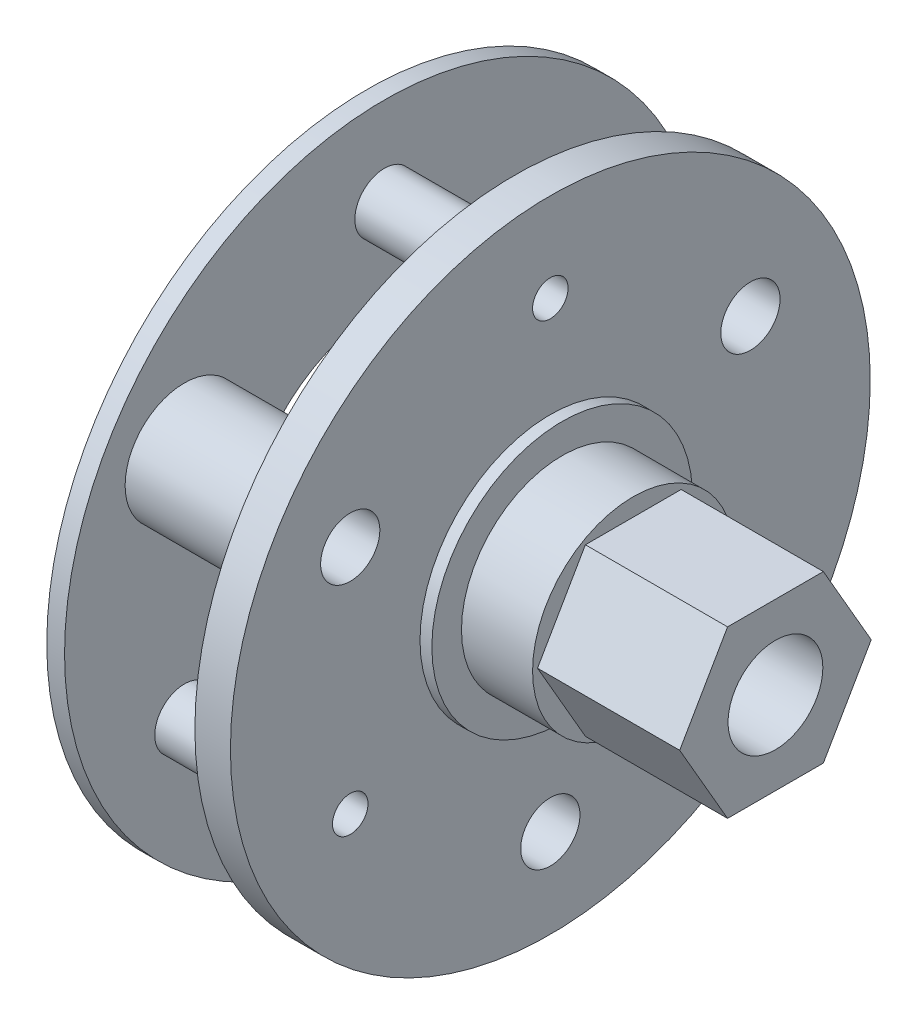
ISO-10303-21;
HEADER;
FILE_DESCRIPTION(('STEP AP214'),'2;1');
FILE_NAME('part.step','',(''),(''),'','','');
FILE_SCHEMA(('AUTOMOTIVE_DESIGN { 1 0 10303 214 1 1 1 1 }'));
ENDSEC;
DATA;
#1=APPLICATION_CONTEXT('core data for automotive mechanical design processes');
#2=APPLICATION_PROTOCOL_DEFINITION('international standard','automotive_design',2000,#1);
#3=PRODUCT_CONTEXT('',#1,'mechanical');
#4=PRODUCT('Part','Part','',(#3));
#5=PRODUCT_RELATED_PRODUCT_CATEGORY('part','',(#4));
#6=PRODUCT_DEFINITION_FORMATION('','',#4);
#7=PRODUCT_DEFINITION_CONTEXT('part definition',#1,'design');
#8=PRODUCT_DEFINITION('design','',#6,#7);
#9=PRODUCT_DEFINITION_SHAPE('','',#8);
#10=(LENGTH_UNIT() NAMED_UNIT(*) SI_UNIT(.MILLI.,.METRE.));
#11=(NAMED_UNIT(*) PLANE_ANGLE_UNIT() SI_UNIT($,.RADIAN.));
#12=(NAMED_UNIT(*) SI_UNIT($,.STERADIAN.) SOLID_ANGLE_UNIT());
#13=UNCERTAINTY_MEASURE_WITH_UNIT(LENGTH_MEASURE(1.E-05),#10,'distance_accuracy_value','');
#14=(GEOMETRIC_REPRESENTATION_CONTEXT(3) GLOBAL_UNCERTAINTY_ASSIGNED_CONTEXT((#13)) GLOBAL_UNIT_ASSIGNED_CONTEXT((#10,
#11,#12)) REPRESENTATION_CONTEXT('',''));
#15=CARTESIAN_POINT('',(0.,0.,0.));
#16=DIRECTION('',(0.,0.,1.));
#17=DIRECTION('',(1.,0.,0.));
#18=AXIS2_PLACEMENT_3D('',#15,#16,#17);
#19=CARTESIAN_POINT('',(0.,0.,0.));
#20=DIRECTION('',(-1.,0.,0.));
#21=DIRECTION('',(0.,0.,1.));
#22=AXIS2_PLACEMENT_3D('',#19,#20,#21);
#23=CYLINDRICAL_SURFACE('',#22,8.5);
#24=CARTESIAN_POINT('',(4.,0.,0.));
#25=DIRECTION('',(-1.,0.,0.));
#26=DIRECTION('',(0.,0.,1.));
#27=AXIS2_PLACEMENT_3D('',#24,#25,#26);
#28=CIRCLE('',#27,8.5);
#29=CARTESIAN_POINT('',(4.,0.,8.5));
#30=VERTEX_POINT('',#29);
#31=EDGE_CURVE('E211',#30,#30,#28,.T.);
#32=ORIENTED_EDGE('',*,*,#31,.F.);
#33=EDGE_LOOP('',(#32));
#34=FACE_BOUND('',#33,.T.);
#35=CARTESIAN_POINT('',(10.,0.,0.));
#36=DIRECTION('',(1.,0.,0.));
#37=DIRECTION('',(0.,0.,-1.));
#38=AXIS2_PLACEMENT_3D('',#35,#36,#37);
#39=CIRCLE('',#38,8.5);
#40=CARTESIAN_POINT('',(10.,0.,-8.5));
#41=VERTEX_POINT('',#40);
#42=EDGE_CURVE('E37',#41,#41,#39,.T.);
#43=ORIENTED_EDGE('',*,*,#42,.F.);
#44=EDGE_LOOP('',(#43));
#45=FACE_BOUND('',#44,.T.);
#46=ADVANCED_FACE('F33',(#34,#45),#23,.T.);
#47=CARTESIAN_POINT('',(22.,8.5,0.));
#48=DIRECTION('',(-1.,0.,0.));
#49=DIRECTION('',(0.,0.,1.));
#50=AXIS2_PLACEMENT_3D('',#47,#48,#49);
#51=PLANE('',#50);
#52=CARTESIAN_POINT('',(22.,0.,0.));
#53=DIRECTION('',(1.,0.,0.));
#54=DIRECTION('',(0.,0.,-1.));
#55=AXIS2_PLACEMENT_3D('',#52,#53,#54);
#56=CIRCLE('',#55,4.);
#57=CARTESIAN_POINT('',(22.,0.,-4.));
#58=VERTEX_POINT('',#57);
#59=EDGE_CURVE('E175',#58,#58,#56,.T.);
#60=ORIENTED_EDGE('',*,*,#59,.F.);
#61=EDGE_LOOP('',(#60));
#62=FACE_BOUND('',#61,.T.);
#63=DIRECTION('',(0.,0.866025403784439,-0.5));
#64=VECTOR('',#63,1.);
#65=CARTESIAN_POINT('',(22.,-7.,-4.04145188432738));
#66=LINE('',#65,#64);
#67=CARTESIAN_POINT('',(22.,-7.,-4.04145188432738));
#68=VERTEX_POINT('',#67);
#69=CARTESIAN_POINT('',(22.,0.,-8.08290376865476));
#70=VERTEX_POINT('',#69);
#71=EDGE_CURVE('E108',#68,#70,#66,.T.);
#72=ORIENTED_EDGE('',*,*,#71,.T.);
#73=DIRECTION('',(0.,0.866025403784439,0.5));
#74=VECTOR('',#73,1.);
#75=CARTESIAN_POINT('',(22.,0.,-8.08290376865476));
#76=LINE('',#75,#74);
#77=CARTESIAN_POINT('',(22.,7.,-4.04145188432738));
#78=VERTEX_POINT('',#77);
#79=EDGE_CURVE('E106',#70,#78,#76,.T.);
#80=ORIENTED_EDGE('',*,*,#79,.T.);
#81=DIRECTION('',(0.,0.,1.));
#82=VECTOR('',#81,1.);
#83=CARTESIAN_POINT('',(22.,7.,-4.04145188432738));
#84=LINE('',#83,#82);
#85=CARTESIAN_POINT('',(22.,7.,4.04145188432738));
#86=VERTEX_POINT('',#85);
#87=EDGE_CURVE('E49',#78,#86,#84,.T.);
#88=ORIENTED_EDGE('',*,*,#87,.T.);
#89=DIRECTION('',(0.,-0.866025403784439,0.5));
#90=VECTOR('',#89,1.);
#91=CARTESIAN_POINT('',(22.,7.,4.04145188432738));
#92=LINE('',#91,#90);
#93=CARTESIAN_POINT('',(22.,0.,8.08290376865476));
#94=VERTEX_POINT('',#93);
#95=EDGE_CURVE('E95',#86,#94,#92,.T.);
#96=ORIENTED_EDGE('',*,*,#95,.T.);
#97=DIRECTION('',(0.,-0.866025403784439,-0.5));
#98=VECTOR('',#97,1.);
#99=CARTESIAN_POINT('',(22.,0.,8.08290376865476));
#100=LINE('',#99,#98);
#101=CARTESIAN_POINT('',(22.,-7.,4.04145188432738));
#102=VERTEX_POINT('',#101);
#103=EDGE_CURVE('E100',#94,#102,#100,.T.);
#104=ORIENTED_EDGE('',*,*,#103,.T.);
#105=DIRECTION('',(0.,0.,-1.));
#106=VECTOR('',#105,1.);
#107=CARTESIAN_POINT('',(22.,-7.,4.04145188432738));
#108=LINE('',#107,#106);
#109=EDGE_CURVE('E113',#102,#68,#108,.T.);
#110=ORIENTED_EDGE('',*,*,#109,.T.);
#111=EDGE_LOOP('',(#72,#80,#88,#96,#104,#110));
#112=FACE_BOUND('',#111,.T.);
#113=ADVANCED_FACE('F104',(#62,#112),#51,.F.);
#114=CARTESIAN_POINT('',(0.,0.,0.));
#115=DIRECTION('',(1.,0.,0.));
#116=DIRECTION('',(0.,0.,-1.));
#117=AXIS2_PLACEMENT_3D('',#114,#115,#116);
#118=PLANE('',#117);
#119=CARTESIAN_POINT('',(0.,0.,0.));
#120=DIRECTION('',(1.,0.,0.));
#121=DIRECTION('',(0.,0.,-1.));
#122=AXIS2_PLACEMENT_3D('',#119,#120,#121);
#123=CIRCLE('',#122,4.);
#124=CARTESIAN_POINT('',(0.,0.,-4.));
#125=VERTEX_POINT('',#124);
#126=EDGE_CURVE('E178',#125,#125,#123,.T.);
#127=ORIENTED_EDGE('',*,*,#126,.T.);
#128=EDGE_LOOP('',(#127));
#129=FACE_BOUND('',#128,.T.);
#130=CARTESIAN_POINT('',(0.,0.,0.));
#131=DIRECTION('',(-1.,0.,0.));
#132=DIRECTION('',(0.,0.,1.));
#133=AXIS2_PLACEMENT_3D('',#130,#131,#132);
#134=CIRCLE('',#133,27.);
#135=CARTESIAN_POINT('',(0.,0.,27.));
#136=VERTEX_POINT('',#135);
#137=EDGE_CURVE('E223',#136,#136,#134,.T.);
#138=ORIENTED_EDGE('',*,*,#137,.T.);
#139=EDGE_LOOP('',(#138));
#140=FACE_BOUND('',#139,.T.);
#141=CARTESIAN_POINT('',(0.,19.5,0.));
#142=DIRECTION('',(1.,0.,0.));
#143=DIRECTION('',(0.,0.,-1.));
#144=AXIS2_PLACEMENT_3D('',#141,#142,#143);
#145=CIRCLE('',#144,2.5);
#146=CARTESIAN_POINT('',(0.,19.5,-2.5));
#147=VERTEX_POINT('',#146);
#148=EDGE_CURVE('E226',#147,#147,#145,.F.);
#149=ORIENTED_EDGE('',*,*,#148,.F.);
#150=EDGE_LOOP('',(#149));
#151=FACE_BOUND('',#150,.T.);
#152=CARTESIAN_POINT('',(0.,9.75000000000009,16.8874953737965));
#153=DIRECTION('',(1.,0.,0.));
#154=DIRECTION('',(0.,0.,-1.));
#155=AXIS2_PLACEMENT_3D('',#152,#153,#154);
#156=CIRCLE('',#155,5.);
#157=CARTESIAN_POINT('',(0.,9.75000000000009,11.8874953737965));
#158=VERTEX_POINT('',#157);
#159=EDGE_CURVE('E229',#158,#158,#156,.F.);
#160=ORIENTED_EDGE('',*,*,#159,.F.);
#161=EDGE_LOOP('',(#160));
#162=FACE_BOUND('',#161,.T.);
#163=CARTESIAN_POINT('',(0.,-9.75000000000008,16.8874953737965));
#164=DIRECTION('',(1.,0.,0.));
#165=DIRECTION('',(0.,0.,-1.));
#166=AXIS2_PLACEMENT_3D('',#163,#164,#165);
#167=CIRCLE('',#166,2.5);
#168=CARTESIAN_POINT('',(0.,-9.75000000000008,14.3874953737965));
#169=VERTEX_POINT('',#168);
#170=EDGE_CURVE('E232',#169,#169,#167,.F.);
#171=ORIENTED_EDGE('',*,*,#170,.F.);
#172=EDGE_LOOP('',(#171));
#173=FACE_BOUND('',#172,.T.);
#174=CARTESIAN_POINT('',(0.,-19.5,0.));
#175=DIRECTION('',(1.,0.,0.));
#176=DIRECTION('',(0.,0.,-1.));
#177=AXIS2_PLACEMENT_3D('',#174,#175,#176);
#178=CIRCLE('',#177,5.);
#179=CARTESIAN_POINT('',(0.,-19.5,-4.99999999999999));
#180=VERTEX_POINT('',#179);
#181=EDGE_CURVE('E235',#180,#180,#178,.F.);
#182=ORIENTED_EDGE('',*,*,#181,.F.);
#183=EDGE_LOOP('',(#182));
#184=FACE_BOUND('',#183,.T.);
#185=CARTESIAN_POINT('',(0.,-9.74999999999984,-16.8874953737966));
#186=DIRECTION('',(1.,0.,0.));
#187=DIRECTION('',(0.,0.,-1.));
#188=AXIS2_PLACEMENT_3D('',#185,#186,#187);
#189=CIRCLE('',#188,2.5);
#190=CARTESIAN_POINT('',(0.,-9.74999999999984,-19.3874953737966));
#191=VERTEX_POINT('',#190);
#192=EDGE_CURVE('E42',#191,#191,#189,.F.);
#193=ORIENTED_EDGE('',*,*,#192,.F.);
#194=EDGE_LOOP('',(#193));
#195=FACE_BOUND('',#194,.T.);
#196=CARTESIAN_POINT('',(0.,9.75000000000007,-16.8874953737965));
#197=DIRECTION('',(1.,0.,0.));
#198=DIRECTION('',(0.,0.,-1.));
#199=AXIS2_PLACEMENT_3D('',#196,#197,#198);
#200=CIRCLE('',#199,5.);
#201=CARTESIAN_POINT('',(0.,9.75000000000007,-21.8874953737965));
#202=VERTEX_POINT('',#201);
#203=EDGE_CURVE('E11',#202,#202,#200,.F.);
#204=ORIENTED_EDGE('',*,*,#203,.F.);
#205=EDGE_LOOP('',(#204));
#206=FACE_BOUND('',#205,.T.);
#207=ADVANCED_FACE('F35',(#129,#140,#151,#162,#173,#184,#195,#206),#118,.F.);
#208=CARTESIAN_POINT('',(0.,0.,0.));
#209=DIRECTION('',(-1.,0.,0.));
#210=DIRECTION('',(0.,0.,1.));
#211=AXIS2_PLACEMENT_3D('',#208,#209,#210);
#212=CYLINDRICAL_SURFACE('',#211,27.);
#213=ORIENTED_EDGE('',*,*,#137,.F.);
#214=EDGE_LOOP('',(#213));
#215=FACE_BOUND('',#214,.T.);
#216=CARTESIAN_POINT('',(3.,0.,0.));
#217=DIRECTION('',(-1.,0.,0.));
#218=DIRECTION('',(0.,0.,1.));
#219=AXIS2_PLACEMENT_3D('',#216,#217,#218);
#220=CIRCLE('',#219,27.);
#221=CARTESIAN_POINT('',(3.,0.,27.));
#222=VERTEX_POINT('',#221);
#223=EDGE_CURVE('E220',#222,#222,#220,.T.);
#224=ORIENTED_EDGE('',*,*,#223,.T.);
#225=EDGE_LOOP('',(#224));
#226=FACE_BOUND('',#225,.T.);
#227=ADVANCED_FACE('F245',(#215,#226),#212,.T.);
#228=CARTESIAN_POINT('',(3.,27.,0.));
#229=DIRECTION('',(-1.,0.,0.));
#230=DIRECTION('',(0.,0.,1.));
#231=AXIS2_PLACEMENT_3D('',#228,#229,#230);
#232=PLANE('',#231);
#233=CARTESIAN_POINT('',(3.,-19.5,-2.61943244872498E-13));
#234=DIRECTION('',(1.,0.,0.));
#235=DIRECTION('',(0.,-0.866025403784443,0.499999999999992));
#236=AXIS2_PLACEMENT_3D('',#233,#234,#235);
#237=CIRCLE('',#236,2.5);
#238=CARTESIAN_POINT('',(3.,-21.6650635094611,1.24999999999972));
#239=VERTEX_POINT('',#238);
#240=EDGE_CURVE('E139',#239,#239,#237,.T.);
#241=ORIENTED_EDGE('',*,*,#240,.F.);
#242=EDGE_LOOP('',(#241));
#243=FACE_BOUND('',#242,.T.);
#244=CARTESIAN_POINT('',(3.,-9.74999999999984,-16.8874953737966));
#245=DIRECTION('',(1.,0.,0.));
#246=DIRECTION('',(0.,-0.866025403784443,0.499999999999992));
#247=AXIS2_PLACEMENT_3D('',#244,#245,#246);
#248=CIRCLE('',#247,1.5);
#249=CARTESIAN_POINT('',(3.,-11.0490381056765,-16.1374953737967));
#250=VERTEX_POINT('',#249);
#251=EDGE_CURVE('E145',#250,#250,#248,.T.);
#252=ORIENTED_EDGE('',*,*,#251,.F.);
#253=EDGE_LOOP('',(#252));
#254=FACE_BOUND('',#253,.T.);
#255=CARTESIAN_POINT('',(3.,9.74999999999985,16.8874953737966));
#256=DIRECTION('',(1.,0.,0.));
#257=DIRECTION('',(0.,0.866025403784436,0.500000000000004));
#258=AXIS2_PLACEMENT_3D('',#255,#256,#257);
#259=CIRCLE('',#258,2.5);
#260=CARTESIAN_POINT('',(3.,11.9150635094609,18.1374953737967));
#261=VERTEX_POINT('',#260);
#262=EDGE_CURVE('E151',#261,#261,#259,.T.);
#263=ORIENTED_EDGE('',*,*,#262,.F.);
#264=EDGE_LOOP('',(#263));
#265=FACE_BOUND('',#264,.T.);
#266=CARTESIAN_POINT('',(3.,-9.75000000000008,16.8874953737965));
#267=DIRECTION('',(1.,0.,0.));
#268=DIRECTION('',(0.,0.866025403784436,0.500000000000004));
#269=AXIS2_PLACEMENT_3D('',#266,#267,#268);
#270=CIRCLE('',#269,1.5);
#271=CARTESIAN_POINT('',(3.,-8.45096189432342,17.6374953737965));
#272=VERTEX_POINT('',#271);
#273=EDGE_CURVE('E157',#272,#272,#270,.T.);
#274=ORIENTED_EDGE('',*,*,#273,.F.);
#275=EDGE_LOOP('',(#274));
#276=FACE_BOUND('',#275,.T.);
#277=CARTESIAN_POINT('',(3.,9.75000000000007,-16.8874953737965));
#278=DIRECTION('',(1.,0.,0.));
#279=DIRECTION('',(0.,0.,-1.));
#280=AXIS2_PLACEMENT_3D('',#277,#278,#279);
#281=CIRCLE('',#280,2.5);
#282=CARTESIAN_POINT('',(3.,9.75000000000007,-19.3874953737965));
#283=VERTEX_POINT('',#282);
#284=EDGE_CURVE('E163',#283,#283,#281,.T.);
#285=ORIENTED_EDGE('',*,*,#284,.F.);
#286=EDGE_LOOP('',(#285));
#287=FACE_BOUND('',#286,.T.);
#288=CARTESIAN_POINT('',(3.,19.5,0.));
#289=DIRECTION('',(1.,0.,0.));
#290=DIRECTION('',(0.,0.,-1.));
#291=AXIS2_PLACEMENT_3D('',#288,#289,#290);
#292=CIRCLE('',#291,1.5);
#293=CARTESIAN_POINT('',(3.,19.5,-1.5));
#294=VERTEX_POINT('',#293);
#295=EDGE_CURVE('E169',#294,#294,#292,.T.);
#296=ORIENTED_EDGE('',*,*,#295,.F.);
#297=EDGE_LOOP('',(#296));
#298=FACE_BOUND('',#297,.T.);
#299=ORIENTED_EDGE('',*,*,#223,.F.);
#300=EDGE_LOOP('',(#299));
#301=FACE_BOUND('',#300,.T.);
#302=CARTESIAN_POINT('',(3.,0.,0.));
#303=DIRECTION('',(-1.,0.,0.));
#304=DIRECTION('',(0.,0.,1.));
#305=AXIS2_PLACEMENT_3D('',#302,#303,#304);
#306=CIRCLE('',#305,11.);
#307=CARTESIAN_POINT('',(3.,0.,11.));
#308=VERTEX_POINT('',#307);
#309=EDGE_CURVE('E217',#308,#308,#306,.T.);
#310=ORIENTED_EDGE('',*,*,#309,.T.);
#311=EDGE_LOOP('',(#310));
#312=FACE_BOUND('',#311,.T.);
#313=ADVANCED_FACE('F287',(#243,#254,#265,#276,#287,#298,#301,#312),#232,.F.);
#314=CARTESIAN_POINT('',(0.,0.,0.));
#315=DIRECTION('',(-1.,0.,0.));
#316=DIRECTION('',(0.,0.,1.));
#317=AXIS2_PLACEMENT_3D('',#314,#315,#316);
#318=CYLINDRICAL_SURFACE('',#317,11.);
#319=ORIENTED_EDGE('',*,*,#309,.F.);
#320=EDGE_LOOP('',(#319));
#321=FACE_BOUND('',#320,.T.);
#322=CARTESIAN_POINT('',(4.,0.,0.));
#323=DIRECTION('',(-1.,0.,0.));
#324=DIRECTION('',(0.,0.,1.));
#325=AXIS2_PLACEMENT_3D('',#322,#323,#324);
#326=CIRCLE('',#325,11.);
#327=CARTESIAN_POINT('',(4.,0.,11.));
#328=VERTEX_POINT('',#327);
#329=EDGE_CURVE('E214',#328,#328,#326,.T.);
#330=ORIENTED_EDGE('',*,*,#329,.T.);
#331=EDGE_LOOP('',(#330));
#332=FACE_BOUND('',#331,.T.);
#333=ADVANCED_FACE('F283',(#321,#332),#318,.T.);
#334=CARTESIAN_POINT('',(4.,11.,0.));
#335=DIRECTION('',(-1.,0.,0.));
#336=DIRECTION('',(0.,0.,1.));
#337=AXIS2_PLACEMENT_3D('',#334,#335,#336);
#338=PLANE('',#337);
#339=ORIENTED_EDGE('',*,*,#329,.F.);
#340=EDGE_LOOP('',(#339));
#341=FACE_BOUND('',#340,.T.);
#342=ORIENTED_EDGE('',*,*,#31,.T.);
#343=EDGE_LOOP('',(#342));
#344=FACE_BOUND('',#343,.T.);
#345=ADVANCED_FACE('F279',(#341,#344),#338,.F.);
#346=CARTESIAN_POINT('',(-11.,19.5,0.));
#347=DIRECTION('',(1.,0.,0.));
#348=DIRECTION('',(0.,0.,-1.));
#349=AXIS2_PLACEMENT_3D('',#346,#347,#348);
#350=CYLINDRICAL_SURFACE('',#349,2.5);
#351=CARTESIAN_POINT('',(-11.,19.5,0.));
#352=DIRECTION('',(-1.,0.,0.));
#353=DIRECTION('',(0.,0.,1.));
#354=AXIS2_PLACEMENT_3D('',#351,#352,#353);
#355=CIRCLE('',#354,2.5);
#356=CARTESIAN_POINT('',(-11.,19.5,2.5));
#357=VERTEX_POINT('',#356);
#358=EDGE_CURVE('E208',#357,#357,#355,.T.);
#359=ORIENTED_EDGE('',*,*,#358,.F.);
#360=EDGE_LOOP('',(#359));
#361=FACE_BOUND('',#360,.T.);
#362=ORIENTED_EDGE('',*,*,#148,.T.);
#363=EDGE_LOOP('',(#362));
#364=FACE_BOUND('',#363,.T.);
#365=ADVANCED_FACE('F282',(#361,#364),#350,.T.);
#366=CARTESIAN_POINT('',(-11.,9.75000000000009,16.8874953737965));
#367=DIRECTION('',(1.,0.,0.));
#368=DIRECTION('',(0.,0.,-1.));
#369=AXIS2_PLACEMENT_3D('',#366,#367,#368);
#370=CYLINDRICAL_SURFACE('',#369,5.);
#371=CARTESIAN_POINT('',(-11.,9.75000000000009,16.8874953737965));
#372=DIRECTION('',(-1.,0.,0.));
#373=DIRECTION('',(0.,0.,1.));
#374=AXIS2_PLACEMENT_3D('',#371,#372,#373);
#375=CIRCLE('',#374,5.);
#376=CARTESIAN_POINT('',(-11.,9.75000000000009,21.8874953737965));
#377=VERTEX_POINT('',#376);
#378=EDGE_CURVE('E205',#377,#377,#375,.T.);
#379=ORIENTED_EDGE('',*,*,#378,.F.);
#380=EDGE_LOOP('',(#379));
#381=FACE_BOUND('',#380,.T.);
#382=ORIENTED_EDGE('',*,*,#159,.T.);
#383=EDGE_LOOP('',(#382));
#384=FACE_BOUND('',#383,.T.);
#385=ADVANCED_FACE('F321',(#381,#384),#370,.T.);
#386=CARTESIAN_POINT('',(-11.,-9.75000000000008,16.8874953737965));
#387=DIRECTION('',(1.,0.,0.));
#388=DIRECTION('',(0.,0.,-1.));
#389=AXIS2_PLACEMENT_3D('',#386,#387,#388);
#390=CYLINDRICAL_SURFACE('',#389,2.5);
#391=CARTESIAN_POINT('',(-11.,-9.75000000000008,16.8874953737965));
#392=DIRECTION('',(-1.,0.,0.));
#393=DIRECTION('',(0.,-0.866025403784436,-0.500000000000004));
#394=AXIS2_PLACEMENT_3D('',#391,#392,#393);
#395=CIRCLE('',#394,2.5);
#396=CARTESIAN_POINT('',(-11.,-11.9150635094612,15.6374953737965));
#397=VERTEX_POINT('',#396);
#398=EDGE_CURVE('E202',#397,#397,#395,.T.);
#399=ORIENTED_EDGE('',*,*,#398,.F.);
#400=EDGE_LOOP('',(#399));
#401=FACE_BOUND('',#400,.T.);
#402=ORIENTED_EDGE('',*,*,#170,.T.);
#403=EDGE_LOOP('',(#402));
#404=FACE_BOUND('',#403,.T.);
#405=ADVANCED_FACE('F315',(#401,#404),#390,.T.);
#406=CARTESIAN_POINT('',(-11.,-19.5,0.));
#407=DIRECTION('',(1.,0.,0.));
#408=DIRECTION('',(0.,0.,-1.));
#409=AXIS2_PLACEMENT_3D('',#406,#407,#408);
#410=CYLINDRICAL_SURFACE('',#409,5.);
#411=CARTESIAN_POINT('',(-11.,-19.5,0.));
#412=DIRECTION('',(-1.,0.,0.));
#413=DIRECTION('',(0.,-0.866025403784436,-0.500000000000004));
#414=AXIS2_PLACEMENT_3D('',#411,#412,#413);
#415=CIRCLE('',#414,5.);
#416=CARTESIAN_POINT('',(-11.,-23.8301270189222,-2.50000000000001));
#417=VERTEX_POINT('',#416);
#418=EDGE_CURVE('E199',#417,#417,#415,.T.);
#419=ORIENTED_EDGE('',*,*,#418,.F.);
#420=EDGE_LOOP('',(#419));
#421=FACE_BOUND('',#420,.T.);
#422=ORIENTED_EDGE('',*,*,#181,.T.);
#423=EDGE_LOOP('',(#422));
#424=FACE_BOUND('',#423,.T.);
#425=ADVANCED_FACE('F261',(#421,#424),#410,.T.);
#426=CARTESIAN_POINT('',(-11.,-9.74999999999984,-16.8874953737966));
#427=DIRECTION('',(1.,0.,0.));
#428=DIRECTION('',(0.,0.,-1.));
#429=AXIS2_PLACEMENT_3D('',#426,#427,#428);
#430=CYLINDRICAL_SURFACE('',#429,2.5);
#431=CARTESIAN_POINT('',(-11.,-9.74999999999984,-16.8874953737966));
#432=DIRECTION('',(-1.,0.,0.));
#433=DIRECTION('',(0.,0.866025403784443,-0.499999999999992));
#434=AXIS2_PLACEMENT_3D('',#431,#432,#433);
#435=CIRCLE('',#434,2.5);
#436=CARTESIAN_POINT('',(-11.,-7.58493649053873,-18.1374953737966));
#437=VERTEX_POINT('',#436);
#438=EDGE_CURVE('E196',#437,#437,#435,.T.);
#439=ORIENTED_EDGE('',*,*,#438,.F.);
#440=EDGE_LOOP('',(#439));
#441=FACE_BOUND('',#440,.T.);
#442=ORIENTED_EDGE('',*,*,#192,.T.);
#443=EDGE_LOOP('',(#442));
#444=FACE_BOUND('',#443,.T.);
#445=ADVANCED_FACE('F241',(#441,#444),#430,.T.);
#446=CARTESIAN_POINT('',(-11.,9.75000000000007,-16.8874953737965));
#447=DIRECTION('',(1.,0.,0.));
#448=DIRECTION('',(0.,0.,-1.));
#449=AXIS2_PLACEMENT_3D('',#446,#447,#448);
#450=CYLINDRICAL_SURFACE('',#449,5.);
#451=CARTESIAN_POINT('',(-11.,9.75000000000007,-16.8874953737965));
#452=DIRECTION('',(-1.,0.,0.));
#453=DIRECTION('',(0.,0.866025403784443,-0.499999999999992));
#454=AXIS2_PLACEMENT_3D('',#451,#452,#453);
#455=CIRCLE('',#454,5.);
#456=CARTESIAN_POINT('',(-11.,14.0801270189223,-19.3874953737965));
#457=VERTEX_POINT('',#456);
#458=EDGE_CURVE('E193',#457,#457,#455,.T.);
#459=ORIENTED_EDGE('',*,*,#458,.F.);
#460=EDGE_LOOP('',(#459));
#461=FACE_BOUND('',#460,.T.);
#462=ORIENTED_EDGE('',*,*,#203,.T.);
#463=EDGE_LOOP('',(#462));
#464=FACE_BOUND('',#463,.T.);
#465=ADVANCED_FACE('F249',(#461,#464),#450,.T.);
#466=CARTESIAN_POINT('',(-12.5,0.,0.));
#467=DIRECTION('',(1.,0.,0.));
#468=DIRECTION('',(0.,0.,-1.));
#469=AXIS2_PLACEMENT_3D('',#466,#467,#468);
#470=CYLINDRICAL_SURFACE('',#469,12.);
#471=CARTESIAN_POINT('',(-12.5,0.,0.));
#472=DIRECTION('',(-1.,0.,0.));
#473=DIRECTION('',(0.,0.,1.));
#474=AXIS2_PLACEMENT_3D('',#471,#472,#473);
#475=CIRCLE('',#474,12.);
#476=CARTESIAN_POINT('',(-12.5,0.,12.));
#477=VERTEX_POINT('',#476);
#478=EDGE_CURVE('E184',#477,#477,#475,.T.);
#479=ORIENTED_EDGE('',*,*,#478,.T.);
#480=EDGE_LOOP('',(#479));
#481=FACE_BOUND('',#480,.T.);
#482=CARTESIAN_POINT('',(-11.,0.,0.));
#483=DIRECTION('',(-1.,0.,0.));
#484=DIRECTION('',(0.,0.,1.));
#485=AXIS2_PLACEMENT_3D('',#482,#483,#484);
#486=CIRCLE('',#485,12.);
#487=CARTESIAN_POINT('',(-11.,0.,12.));
#488=VERTEX_POINT('',#487);
#489=EDGE_CURVE('E181',#488,#488,#486,.T.);
#490=ORIENTED_EDGE('',*,*,#489,.F.);
#491=EDGE_LOOP('',(#490));
#492=FACE_BOUND('',#491,.T.);
#493=ADVANCED_FACE('F251',(#481,#492),#470,.F.);
#494=CARTESIAN_POINT('',(-12.5,0.,0.));
#495=DIRECTION('',(1.,0.,0.));
#496=DIRECTION('',(0.,0.,-1.));
#497=AXIS2_PLACEMENT_3D('',#494,#495,#496);
#498=CYLINDRICAL_SURFACE('',#497,27.);
#499=CARTESIAN_POINT('',(-12.5,0.,0.));
#500=DIRECTION('',(-1.,0.,0.));
#501=DIRECTION('',(0.,0.,1.));
#502=AXIS2_PLACEMENT_3D('',#499,#500,#501);
#503=CIRCLE('',#502,27.);
#504=CARTESIAN_POINT('',(-12.5,0.,27.));
#505=VERTEX_POINT('',#504);
#506=EDGE_CURVE('E190',#505,#505,#503,.T.);
#507=ORIENTED_EDGE('',*,*,#506,.F.);
#508=EDGE_LOOP('',(#507));
#509=FACE_BOUND('',#508,.T.);
#510=CARTESIAN_POINT('',(-11.,0.,0.));
#511=DIRECTION('',(-1.,0.,0.));
#512=DIRECTION('',(0.,0.,1.));
#513=AXIS2_PLACEMENT_3D('',#510,#511,#512);
#514=CIRCLE('',#513,27.);
#515=CARTESIAN_POINT('',(-11.,0.,27.));
#516=VERTEX_POINT('',#515);
#517=EDGE_CURVE('E187',#516,#516,#514,.T.);
#518=ORIENTED_EDGE('',*,*,#517,.T.);
#519=EDGE_LOOP('',(#518));
#520=FACE_BOUND('',#519,.T.);
#521=ADVANCED_FACE('F258',(#509,#520),#498,.T.);
#522=CARTESIAN_POINT('',(-12.5,0.,0.));
#523=DIRECTION('',(-1.,0.,0.));
#524=DIRECTION('',(0.,0.,1.));
#525=AXIS2_PLACEMENT_3D('',#522,#523,#524);
#526=PLANE('',#525);
#527=CARTESIAN_POINT('',(-12.5,-19.5,-2.61943244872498E-13));
#528=DIRECTION('',(1.,0.,0.));
#529=DIRECTION('',(0.,-0.866025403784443,0.499999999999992));
#530=AXIS2_PLACEMENT_3D('',#527,#528,#529);
#531=CIRCLE('',#530,2.5);
#532=CARTESIAN_POINT('',(-12.5,-21.6650635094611,1.24999999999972));
#533=VERTEX_POINT('',#532);
#534=EDGE_CURVE('E142',#533,#533,#531,.T.);
#535=ORIENTED_EDGE('',*,*,#534,.T.);
#536=EDGE_LOOP('',(#535));
#537=FACE_BOUND('',#536,.T.);
#538=CARTESIAN_POINT('',(-12.5,-9.74999999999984,-16.8874953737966));
#539=DIRECTION('',(1.,0.,0.));
#540=DIRECTION('',(0.,-0.866025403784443,0.499999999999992));
#541=AXIS2_PLACEMENT_3D('',#538,#539,#540);
#542=CIRCLE('',#541,1.5);
#543=CARTESIAN_POINT('',(-12.5,-11.0490381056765,-16.1374953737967));
#544=VERTEX_POINT('',#543);
#545=EDGE_CURVE('E148',#544,#544,#542,.T.);
#546=ORIENTED_EDGE('',*,*,#545,.T.);
#547=EDGE_LOOP('',(#546));
#548=FACE_BOUND('',#547,.T.);
#549=CARTESIAN_POINT('',(-12.5,9.74999999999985,16.8874953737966));
#550=DIRECTION('',(1.,0.,0.));
#551=DIRECTION('',(0.,0.866025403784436,0.500000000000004));
#552=AXIS2_PLACEMENT_3D('',#549,#550,#551);
#553=CIRCLE('',#552,2.5);
#554=CARTESIAN_POINT('',(-12.5,11.9150635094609,18.1374953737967));
#555=VERTEX_POINT('',#554);
#556=EDGE_CURVE('E154',#555,#555,#553,.T.);
#557=ORIENTED_EDGE('',*,*,#556,.T.);
#558=EDGE_LOOP('',(#557));
#559=FACE_BOUND('',#558,.T.);
#560=CARTESIAN_POINT('',(-12.5,-9.75000000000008,16.8874953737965));
#561=DIRECTION('',(1.,0.,0.));
#562=DIRECTION('',(0.,0.866025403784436,0.500000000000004));
#563=AXIS2_PLACEMENT_3D('',#560,#561,#562);
#564=CIRCLE('',#563,1.5);
#565=CARTESIAN_POINT('',(-12.5,-8.45096189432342,17.6374953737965));
#566=VERTEX_POINT('',#565);
#567=EDGE_CURVE('E160',#566,#566,#564,.T.);
#568=ORIENTED_EDGE('',*,*,#567,.T.);
#569=EDGE_LOOP('',(#568));
#570=FACE_BOUND('',#569,.T.);
#571=CARTESIAN_POINT('',(-12.5,9.75000000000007,-16.8874953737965));
#572=DIRECTION('',(1.,0.,0.));
#573=DIRECTION('',(0.,0.,-1.));
#574=AXIS2_PLACEMENT_3D('',#571,#572,#573);
#575=CIRCLE('',#574,2.5);
#576=CARTESIAN_POINT('',(-12.5,9.75000000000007,-19.3874953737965));
#577=VERTEX_POINT('',#576);
#578=EDGE_CURVE('E166',#577,#577,#575,.T.);
#579=ORIENTED_EDGE('',*,*,#578,.T.);
#580=EDGE_LOOP('',(#579));
#581=FACE_BOUND('',#580,.T.);
#582=CARTESIAN_POINT('',(-12.5,19.5,0.));
#583=DIRECTION('',(1.,0.,0.));
#584=DIRECTION('',(0.,0.,-1.));
#585=AXIS2_PLACEMENT_3D('',#582,#583,#584);
#586=CIRCLE('',#585,1.5);
#587=CARTESIAN_POINT('',(-12.5,19.5,-1.5));
#588=VERTEX_POINT('',#587);
#589=EDGE_CURVE('E172',#588,#588,#586,.T.);
#590=ORIENTED_EDGE('',*,*,#589,.T.);
#591=EDGE_LOOP('',(#590));
#592=FACE_BOUND('',#591,.T.);
#593=ORIENTED_EDGE('',*,*,#506,.T.);
#594=EDGE_LOOP('',(#593));
#595=FACE_BOUND('',#594,.T.);
#596=ORIENTED_EDGE('',*,*,#478,.F.);
#597=EDGE_LOOP('',(#596));
#598=FACE_BOUND('',#597,.T.);
#599=ADVANCED_FACE('F354',(#537,#548,#559,#570,#581,#592,#595,#598),#526,.T.);
#600=CARTESIAN_POINT('',(-11.,0.,0.));
#601=DIRECTION('',(-1.,0.,0.));
#602=DIRECTION('',(0.,0.,1.));
#603=AXIS2_PLACEMENT_3D('',#600,#601,#602);
#604=PLANE('',#603);
#605=ORIENTED_EDGE('',*,*,#517,.F.);
#606=EDGE_LOOP('',(#605));
#607=FACE_BOUND('',#606,.T.);
#608=ORIENTED_EDGE('',*,*,#489,.T.);
#609=EDGE_LOOP('',(#608));
#610=FACE_BOUND('',#609,.T.);
#611=ORIENTED_EDGE('',*,*,#458,.T.);
#612=EDGE_LOOP('',(#611));
#613=FACE_BOUND('',#612,.T.);
#614=ORIENTED_EDGE('',*,*,#438,.T.);
#615=EDGE_LOOP('',(#614));
#616=FACE_BOUND('',#615,.T.);
#617=ORIENTED_EDGE('',*,*,#418,.T.);
#618=EDGE_LOOP('',(#617));
#619=FACE_BOUND('',#618,.T.);
#620=ORIENTED_EDGE('',*,*,#398,.T.);
#621=EDGE_LOOP('',(#620));
#622=FACE_BOUND('',#621,.T.);
#623=ORIENTED_EDGE('',*,*,#378,.T.);
#624=EDGE_LOOP('',(#623));
#625=FACE_BOUND('',#624,.T.);
#626=ORIENTED_EDGE('',*,*,#358,.T.);
#627=EDGE_LOOP('',(#626));
#628=FACE_BOUND('',#627,.T.);
#629=ADVANCED_FACE('F352',(#607,#610,#613,#616,#619,#622,#625,#628),#604,.F.);
#630=CARTESIAN_POINT('',(-12.5,0.,0.));
#631=DIRECTION('',(1.,0.,0.));
#632=DIRECTION('',(0.,0.,-1.));
#633=AXIS2_PLACEMENT_3D('',#630,#631,#632);
#634=CYLINDRICAL_SURFACE('',#633,4.);
#635=ORIENTED_EDGE('',*,*,#59,.T.);
#636=EDGE_LOOP('',(#635));
#637=FACE_BOUND('',#636,.T.);
#638=ORIENTED_EDGE('',*,*,#126,.F.);
#639=EDGE_LOOP('',(#638));
#640=FACE_BOUND('',#639,.T.);
#641=ADVANCED_FACE('F343',(#637,#640),#634,.F.);
#642=CARTESIAN_POINT('',(-11.,19.5,0.));
#643=DIRECTION('',(1.,0.,0.));
#644=DIRECTION('',(0.,0.,-1.));
#645=AXIS2_PLACEMENT_3D('',#642,#643,#644);
#646=CYLINDRICAL_SURFACE('',#645,1.5);
#647=ORIENTED_EDGE('',*,*,#589,.F.);
#648=EDGE_LOOP('',(#647));
#649=FACE_BOUND('',#648,.T.);
#650=ORIENTED_EDGE('',*,*,#295,.T.);
#651=EDGE_LOOP('',(#650));
#652=FACE_BOUND('',#651,.T.);
#653=ADVANCED_FACE('F341',(#649,#652),#646,.F.);
#654=CARTESIAN_POINT('',(-11.,9.75000000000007,-16.8874953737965));
#655=DIRECTION('',(1.,0.,0.));
#656=DIRECTION('',(0.,0.,-1.));
#657=AXIS2_PLACEMENT_3D('',#654,#655,#656);
#658=CYLINDRICAL_SURFACE('',#657,2.5);
#659=ORIENTED_EDGE('',*,*,#578,.F.);
#660=EDGE_LOOP('',(#659));
#661=FACE_BOUND('',#660,.T.);
#662=ORIENTED_EDGE('',*,*,#284,.T.);
#663=EDGE_LOOP('',(#662));
#664=FACE_BOUND('',#663,.T.);
#665=ADVANCED_FACE('F331',(#661,#664),#658,.F.);
#666=CARTESIAN_POINT('',(-11.,-9.75000000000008,16.8874953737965));
#667=DIRECTION('',(1.,0.,0.));
#668=DIRECTION('',(0.,0.,-1.));
#669=AXIS2_PLACEMENT_3D('',#666,#667,#668);
#670=CYLINDRICAL_SURFACE('',#669,1.5);
#671=ORIENTED_EDGE('',*,*,#567,.F.);
#672=EDGE_LOOP('',(#671));
#673=FACE_BOUND('',#672,.T.);
#674=ORIENTED_EDGE('',*,*,#273,.T.);
#675=EDGE_LOOP('',(#674));
#676=FACE_BOUND('',#675,.T.);
#677=ADVANCED_FACE('F328',(#673,#676),#670,.F.);
#678=CARTESIAN_POINT('',(-11.,9.75000000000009,16.8874953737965));
#679=DIRECTION('',(1.,0.,0.));
#680=DIRECTION('',(0.,0.,-1.));
#681=AXIS2_PLACEMENT_3D('',#678,#679,#680);
#682=CYLINDRICAL_SURFACE('',#681,2.5);
#683=ORIENTED_EDGE('',*,*,#556,.F.);
#684=EDGE_LOOP('',(#683));
#685=FACE_BOUND('',#684,.T.);
#686=ORIENTED_EDGE('',*,*,#262,.T.);
#687=EDGE_LOOP('',(#686));
#688=FACE_BOUND('',#687,.T.);
#689=ADVANCED_FACE('F330',(#685,#688),#682,.F.);
#690=CARTESIAN_POINT('',(-11.,-9.74999999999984,-16.8874953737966));
#691=DIRECTION('',(1.,0.,0.));
#692=DIRECTION('',(0.,0.,-1.));
#693=AXIS2_PLACEMENT_3D('',#690,#691,#692);
#694=CYLINDRICAL_SURFACE('',#693,1.5);
#695=ORIENTED_EDGE('',*,*,#545,.F.);
#696=EDGE_LOOP('',(#695));
#697=FACE_BOUND('',#696,.T.);
#698=ORIENTED_EDGE('',*,*,#251,.T.);
#699=EDGE_LOOP('',(#698));
#700=FACE_BOUND('',#699,.T.);
#701=ADVANCED_FACE('F336',(#697,#700),#694,.F.);
#702=CARTESIAN_POINT('',(-11.,-19.5,0.));
#703=DIRECTION('',(1.,0.,0.));
#704=DIRECTION('',(0.,0.,-1.));
#705=AXIS2_PLACEMENT_3D('',#702,#703,#704);
#706=CYLINDRICAL_SURFACE('',#705,2.5);
#707=ORIENTED_EDGE('',*,*,#534,.F.);
#708=EDGE_LOOP('',(#707));
#709=FACE_BOUND('',#708,.T.);
#710=ORIENTED_EDGE('',*,*,#240,.T.);
#711=EDGE_LOOP('',(#710));
#712=FACE_BOUND('',#711,.T.);
#713=ADVANCED_FACE('F327',(#709,#712),#706,.F.);
#714=CARTESIAN_POINT('',(10.,0.,0.));
#715=DIRECTION('',(1.,0.,0.));
#716=DIRECTION('',(0.,0.,-1.));
#717=AXIS2_PLACEMENT_3D('',#714,#715,#716);
#718=PLANE('',#717);
#719=DIRECTION('',(0.,0.,-1.));
#720=VECTOR('',#719,1.);
#721=CARTESIAN_POINT('',(10.,-7.,4.04145188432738));
#722=LINE('',#721,#720);
#723=CARTESIAN_POINT('',(10.,-7.,4.04145188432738));
#724=VERTEX_POINT('',#723);
#725=CARTESIAN_POINT('',(10.,-7.,-4.04145188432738));
#726=VERTEX_POINT('',#725);
#727=EDGE_CURVE('E128',#724,#726,#722,.T.);
#728=ORIENTED_EDGE('',*,*,#727,.F.);
#729=DIRECTION('',(0.,-0.866025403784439,-0.5));
#730=VECTOR('',#729,1.);
#731=CARTESIAN_POINT('',(10.,0.,8.08290376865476));
#732=LINE('',#731,#730);
#733=CARTESIAN_POINT('',(10.,0.,8.08290376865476));
#734=VERTEX_POINT('',#733);
#735=EDGE_CURVE('E125',#734,#724,#732,.T.);
#736=ORIENTED_EDGE('',*,*,#735,.F.);
#737=DIRECTION('',(0.,-0.866025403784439,0.5));
#738=VECTOR('',#737,1.);
#739=CARTESIAN_POINT('',(10.,7.,4.04145188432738));
#740=LINE('',#739,#738);
#741=CARTESIAN_POINT('',(10.,7.,4.04145188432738));
#742=VERTEX_POINT('',#741);
#743=EDGE_CURVE('E123',#742,#734,#740,.T.);
#744=ORIENTED_EDGE('',*,*,#743,.F.);
#745=DIRECTION('',(0.,0.,1.));
#746=VECTOR('',#745,1.);
#747=CARTESIAN_POINT('',(10.,7.,-4.04145188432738));
#748=LINE('',#747,#746);
#749=CARTESIAN_POINT('',(10.,7.,-4.04145188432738));
#750=VERTEX_POINT('',#749);
#751=EDGE_CURVE('E57',#750,#742,#748,.T.);
#752=ORIENTED_EDGE('',*,*,#751,.F.);
#753=DIRECTION('',(0.,0.866025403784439,0.5));
#754=VECTOR('',#753,1.);
#755=CARTESIAN_POINT('',(10.,0.,-8.08290376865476));
#756=LINE('',#755,#754);
#757=CARTESIAN_POINT('',(10.,0.,-8.08290376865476));
#758=VERTEX_POINT('',#757);
#759=EDGE_CURVE('E119',#758,#750,#756,.T.);
#760=ORIENTED_EDGE('',*,*,#759,.F.);
#761=DIRECTION('',(0.,0.866025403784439,-0.5));
#762=VECTOR('',#761,1.);
#763=CARTESIAN_POINT('',(10.,-7.,-4.04145188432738));
#764=LINE('',#763,#762);
#765=EDGE_CURVE('E116',#726,#758,#764,.T.);
#766=ORIENTED_EDGE('',*,*,#765,.F.);
#767=EDGE_LOOP('',(#728,#736,#744,#752,#760,#766));
#768=FACE_BOUND('',#767,.T.);
#769=ORIENTED_EDGE('',*,*,#42,.T.);
#770=EDGE_LOOP('',(#769));
#771=FACE_BOUND('',#770,.T.);
#772=ADVANCED_FACE('F425',(#768,#771),#718,.T.);
#773=CARTESIAN_POINT('',(10.,-7.,-4.04145188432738));
#774=DIRECTION('',(0.,-0.5,-0.866025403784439));
#775=DIRECTION('',(0.,0.866025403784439,-0.5));
#776=AXIS2_PLACEMENT_3D('',#773,#774,#775);
#777=PLANE('',#776);
#778=ORIENTED_EDGE('',*,*,#71,.F.);
#779=DIRECTION('',(1.,0.,0.));
#780=VECTOR('',#779,1.);
#781=CARTESIAN_POINT('',(10.,-7.,-4.04145188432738));
#782=LINE('',#781,#780);
#783=EDGE_CURVE('E132',#726,#68,#782,.T.);
#784=ORIENTED_EDGE('',*,*,#783,.F.);
#785=ORIENTED_EDGE('',*,*,#765,.T.);
#786=DIRECTION('',(1.,0.,0.));
#787=VECTOR('',#786,1.);
#788=CARTESIAN_POINT('',(10.,0.,-8.08290376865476));
#789=LINE('',#788,#787);
#790=EDGE_CURVE('E131',#758,#70,#789,.T.);
#791=ORIENTED_EDGE('',*,*,#790,.T.);
#792=EDGE_LOOP('',(#778,#784,#785,#791));
#793=FACE_BOUND('',#792,.T.);
#794=ADVANCED_FACE('F432',(#793),#777,.T.);
#795=CARTESIAN_POINT('',(10.,-7.,4.04145188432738));
#796=DIRECTION('',(0.,-1.,0.));
#797=DIRECTION('',(0.,0.,-1.));
#798=AXIS2_PLACEMENT_3D('',#795,#796,#797);
#799=PLANE('',#798);
#800=ORIENTED_EDGE('',*,*,#109,.F.);
#801=DIRECTION('',(1.,0.,0.));
#802=VECTOR('',#801,1.);
#803=CARTESIAN_POINT('',(10.,-7.,4.04145188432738));
#804=LINE('',#803,#802);
#805=EDGE_CURVE('E134',#724,#102,#804,.T.);
#806=ORIENTED_EDGE('',*,*,#805,.F.);
#807=ORIENTED_EDGE('',*,*,#727,.T.);
#808=ORIENTED_EDGE('',*,*,#783,.T.);
#809=EDGE_LOOP('',(#800,#806,#807,#808));
#810=FACE_BOUND('',#809,.T.);
#811=ADVANCED_FACE('F440',(#810),#799,.T.);
#812=CARTESIAN_POINT('',(10.,0.,8.08290376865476));
#813=DIRECTION('',(0.,-0.5,0.866025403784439));
#814=DIRECTION('',(0.,-0.866025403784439,-0.5));
#815=AXIS2_PLACEMENT_3D('',#812,#813,#814);
#816=PLANE('',#815);
#817=ORIENTED_EDGE('',*,*,#103,.F.);
#818=DIRECTION('',(1.,0.,0.));
#819=VECTOR('',#818,1.);
#820=CARTESIAN_POINT('',(10.,0.,8.08290376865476));
#821=LINE('',#820,#819);
#822=EDGE_CURVE('E91',#734,#94,#821,.T.);
#823=ORIENTED_EDGE('',*,*,#822,.F.);
#824=ORIENTED_EDGE('',*,*,#735,.T.);
#825=ORIENTED_EDGE('',*,*,#805,.T.);
#826=EDGE_LOOP('',(#817,#823,#824,#825));
#827=FACE_BOUND('',#826,.T.);
#828=ADVANCED_FACE('F448',(#827),#816,.T.);
#829=CARTESIAN_POINT('',(10.,7.,4.04145188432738));
#830=DIRECTION('',(0.,0.5,0.866025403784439));
#831=DIRECTION('',(0.,-0.866025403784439,0.5));
#832=AXIS2_PLACEMENT_3D('',#829,#830,#831);
#833=PLANE('',#832);
#834=ORIENTED_EDGE('',*,*,#95,.F.);
#835=DIRECTION('',(1.,0.,0.));
#836=VECTOR('',#835,1.);
#837=CARTESIAN_POINT('',(10.,7.,4.04145188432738));
#838=LINE('',#837,#836);
#839=EDGE_CURVE('E86',#742,#86,#838,.T.);
#840=ORIENTED_EDGE('',*,*,#839,.F.);
#841=ORIENTED_EDGE('',*,*,#743,.T.);
#842=ORIENTED_EDGE('',*,*,#822,.T.);
#843=EDGE_LOOP('',(#834,#840,#841,#842));
#844=FACE_BOUND('',#843,.T.);
#845=ADVANCED_FACE('F96',(#844),#833,.T.);
#846=CARTESIAN_POINT('',(10.,7.,-4.04145188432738));
#847=DIRECTION('',(0.,1.,0.));
#848=DIRECTION('',(0.,0.,1.));
#849=AXIS2_PLACEMENT_3D('',#846,#847,#848);
#850=PLANE('',#849);
#851=ORIENTED_EDGE('',*,*,#87,.F.);
#852=DIRECTION('',(1.,0.,0.));
#853=VECTOR('',#852,1.);
#854=CARTESIAN_POINT('',(10.,7.,-4.04145188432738));
#855=LINE('',#854,#853);
#856=EDGE_CURVE('E92',#750,#78,#855,.T.);
#857=ORIENTED_EDGE('',*,*,#856,.F.);
#858=ORIENTED_EDGE('',*,*,#751,.T.);
#859=ORIENTED_EDGE('',*,*,#839,.T.);
#860=EDGE_LOOP('',(#851,#857,#858,#859));
#861=FACE_BOUND('',#860,.T.);
#862=ADVANCED_FACE('F88',(#861),#850,.T.);
#863=CARTESIAN_POINT('',(10.,0.,-8.08290376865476));
#864=DIRECTION('',(0.,0.5,-0.866025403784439));
#865=DIRECTION('',(0.,0.866025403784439,0.5));
#866=AXIS2_PLACEMENT_3D('',#863,#864,#865);
#867=PLANE('',#866);
#868=ORIENTED_EDGE('',*,*,#79,.F.);
#869=ORIENTED_EDGE('',*,*,#790,.F.);
#870=ORIENTED_EDGE('',*,*,#759,.T.);
#871=ORIENTED_EDGE('',*,*,#856,.T.);
#872=EDGE_LOOP('',(#868,#869,#870,#871));
#873=FACE_BOUND('',#872,.T.);
#874=ADVANCED_FACE('F469',(#873),#867,.T.);
#875=CLOSED_SHELL('',(#46,#113,#207,#227,#313,#333,#345,#365,#385,#405,#425,#445,#465,#493,#521,
#599,#629,#641,#653,#665,#677,#689,#701,#713,#772,#794,#811,#828,#845,#862,#874));
#876=MANIFOLD_SOLID_BREP('B2',#875);
#877=ADVANCED_BREP_SHAPE_REPRESENTATION('',(#18,#876),#14);
#878=SHAPE_DEFINITION_REPRESENTATION(#9,#877);
ENDSEC;
END-ISO-10303-21;
